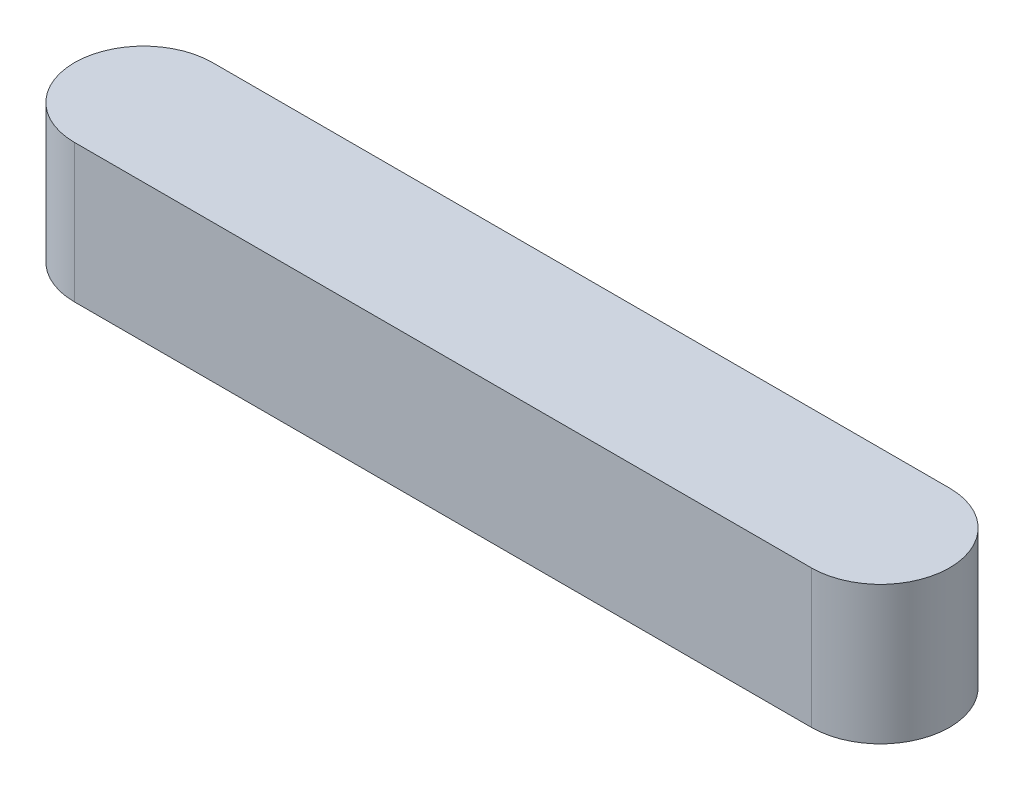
from build123d import *

# Parameters (mm, degrees)
EXTRUSION1_DEPTH = 6


with BuildPart() as part:
    # Esquisse1 → Extrusion1 (new body)
    with BuildSketch(Plane(origin=(0, 0, 0), x_dir=(1, 0, 0), z_dir=(0, 1, 0))):
        with BuildLine():
            Line((0, 3), (32, 3))
            ThreePointArc((32, 3), (35, 0), (32, -3))
            Line((32, -3), (0, -3))
            ThreePointArc((0, -3), (-3, 0), (0, 3))
        make_face()
    extrude(amount=EXTRUSION1_DEPTH)


solid = part.part
